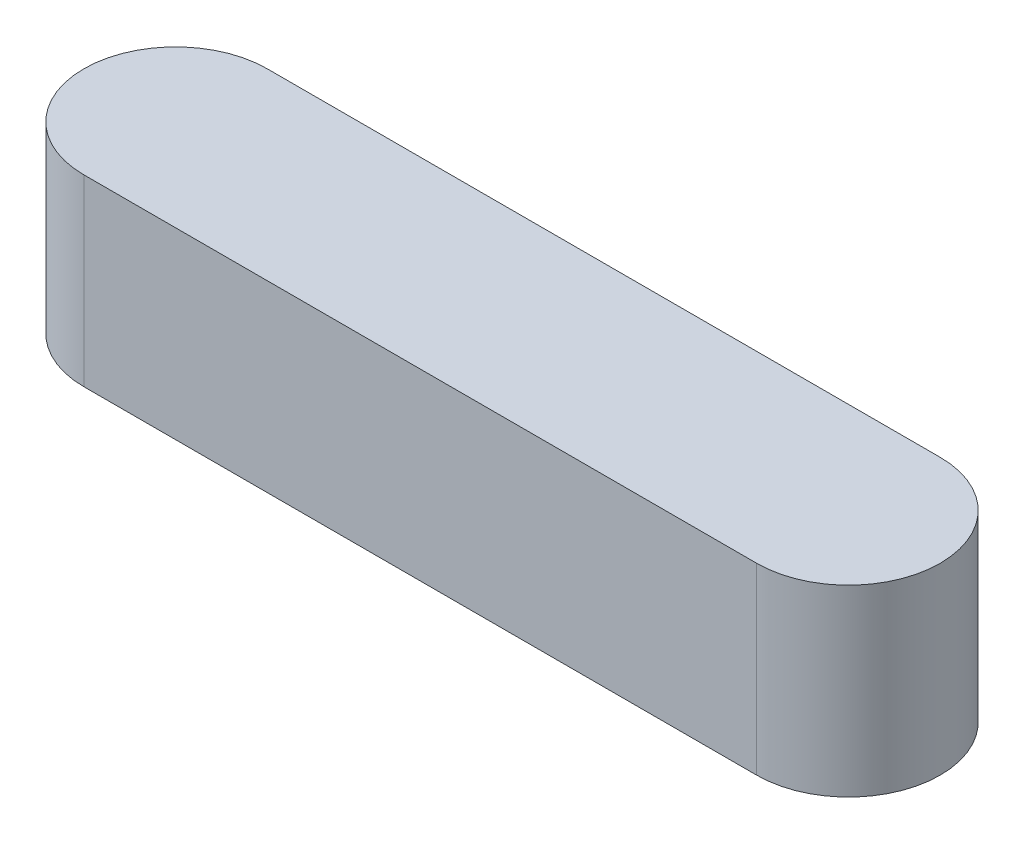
from build123d import *

# Parameters (mm, degrees)
EXTRUDE_1_DEPTH = 3


with BuildPart() as part:
    # Sketch 1 → Extrude 1 (new body)
    with BuildSketch(Plane(origin=(0, 0, 0), x_dir=(1, 0, 0), z_dir=(0, 1, 0))):
        with BuildLine():
            Line((0, 1.5), (11, 1.5))
            ThreePointArc((11, 1.5), (12.5, 0), (11, -1.5))
            Line((11, -1.5), (0, -1.5))
            ThreePointArc((0, -1.5), (-1.5, 0), (0, 1.5))
        make_face()
    extrude(amount=EXTRUDE_1_DEPTH)


solid = part.part
